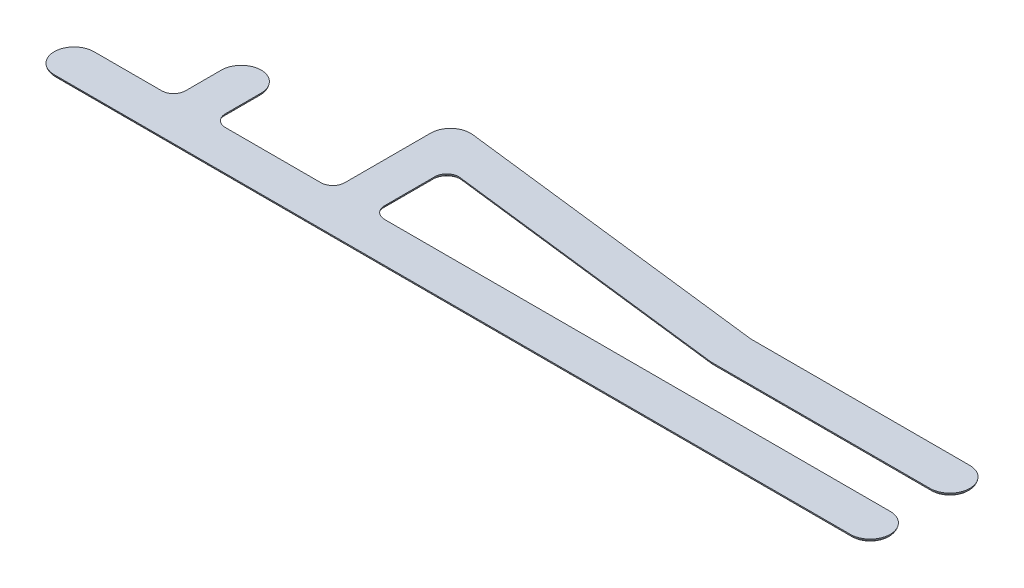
ISO-10303-21;
HEADER;
FILE_DESCRIPTION(('STEP AP214'),'2;1');
FILE_NAME('part.step','',(''),(''),'','','');
FILE_SCHEMA(('AUTOMOTIVE_DESIGN { 1 0 10303 214 1 1 1 1 }'));
ENDSEC;
DATA;
#1=APPLICATION_CONTEXT('core data for automotive mechanical design processes');
#2=APPLICATION_PROTOCOL_DEFINITION('international standard','automotive_design',2000,#1);
#3=PRODUCT_CONTEXT('',#1,'mechanical');
#4=PRODUCT('Part','Part','',(#3));
#5=PRODUCT_RELATED_PRODUCT_CATEGORY('part','',(#4));
#6=PRODUCT_DEFINITION_FORMATION('','',#4);
#7=PRODUCT_DEFINITION_CONTEXT('part definition',#1,'design');
#8=PRODUCT_DEFINITION('design','',#6,#7);
#9=PRODUCT_DEFINITION_SHAPE('','',#8);
#10=(LENGTH_UNIT() NAMED_UNIT(*) SI_UNIT(.MILLI.,.METRE.));
#11=(NAMED_UNIT(*) PLANE_ANGLE_UNIT() SI_UNIT($,.RADIAN.));
#12=(NAMED_UNIT(*) SI_UNIT($,.STERADIAN.) SOLID_ANGLE_UNIT());
#13=UNCERTAINTY_MEASURE_WITH_UNIT(LENGTH_MEASURE(1.E-05),#10,'distance_accuracy_value','');
#14=(GEOMETRIC_REPRESENTATION_CONTEXT(3) GLOBAL_UNCERTAINTY_ASSIGNED_CONTEXT((#13)) GLOBAL_UNIT_ASSIGNED_CONTEXT((#10,
#11,#12)) REPRESENTATION_CONTEXT('',''));
#15=CARTESIAN_POINT('',(0.,0.,0.));
#16=DIRECTION('',(0.,0.,1.));
#17=DIRECTION('',(1.,0.,0.));
#18=AXIS2_PLACEMENT_3D('',#15,#16,#17);
#19=CARTESIAN_POINT('',(200.,-1.,0.));
#20=DIRECTION('',(0.,-1.,0.));
#21=DIRECTION('',(0.,0.,-1.));
#22=AXIS2_PLACEMENT_3D('',#19,#20,#21);
#23=PLANE('',#22);
#24=DIRECTION('',(1.,0.,0.));
#25=VECTOR('',#24,1.);
#26=CARTESIAN_POINT('',(57.,-1.,-3.81678404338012));
#27=LINE('',#26,#25);
#28=CARTESIAN_POINT('',(33.,-1.,-3.81678404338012));
#29=VERTEX_POINT('',#28);
#30=CARTESIAN_POINT('',(57.,-1.,-3.81678404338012));
#31=VERTEX_POINT('',#30);
#32=EDGE_CURVE('E337',#29,#31,#27,.T.);
#33=ORIENTED_EDGE('',*,*,#32,.T.);
#34=CARTESIAN_POINT('',(57.,-1.,-8.00000000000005));
#35=DIRECTION('',(0.,-1.,0.));
#36=DIRECTION('',(0.,0.,-1.));
#37=AXIS2_PLACEMENT_3D('',#34,#35,#36);
#38=CIRCLE('',#37,4.18321595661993);
#39=CARTESIAN_POINT('',(61.18321595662,-1.,-8.00000000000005));
#40=VERTEX_POINT('',#39);
#41=EDGE_CURVE('E11',#31,#40,#38,.F.);
#42=ORIENTED_EDGE('',*,*,#41,.T.);
#43=DIRECTION('',(0.,0.,-1.));
#44=VECTOR('',#43,1.);
#45=CARTESIAN_POINT('',(61.18321595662,-1.,-29.56));
#46=LINE('',#45,#44);
#47=CARTESIAN_POINT('',(61.18321595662,-1.,-29.56));
#48=VERTEX_POINT('',#47);
#49=EDGE_CURVE('E41',#40,#48,#46,.T.);
#50=ORIENTED_EDGE('',*,*,#49,.T.);
#51=CARTESIAN_POINT('',(65.0000000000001,-1.,-29.56));
#52=DIRECTION('',(0.,-1.,0.));
#53=DIRECTION('',(0.,0.,-1.));
#54=AXIS2_PLACEMENT_3D('',#51,#52,#53);
#55=CIRCLE('',#54,3.81678404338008);
#56=CARTESIAN_POINT('',(65.4545573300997,-1.,-33.3496197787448));
#57=VERTEX_POINT('',#56);
#58=EDGE_CURVE('E262',#48,#57,#55,.T.);
#59=ORIENTED_EDGE('',*,*,#58,.T.);
#60=DIRECTION('',(0.992882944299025,0.,0.119094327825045));
#61=VECTOR('',#60,1.);
#62=CARTESIAN_POINT('',(144.562413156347,-1.,-23.8607903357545));
#63=LINE('',#62,#61);
#64=CARTESIAN_POINT('',(144.562413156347,-1.,-23.8607903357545));
#65=VERTEX_POINT('',#64);
#66=EDGE_CURVE('E260',#57,#65,#63,.T.);
#67=ORIENTED_EDGE('',*,*,#66,.T.);
#68=CARTESIAN_POINT('',(145.298799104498,-1.,-30.));
#69=DIRECTION('',(0.,-1.,0.));
#70=DIRECTION('',(0.,0.,-1.));
#71=AXIS2_PLACEMENT_3D('',#68,#69,#70);
#72=CIRCLE('',#71,6.18321595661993);
#73=CARTESIAN_POINT('',(145.298799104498,-1.,-23.8167840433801));
#74=VERTEX_POINT('',#73);
#75=EDGE_CURVE('E258',#65,#74,#72,.F.);
#76=ORIENTED_EDGE('',*,*,#75,.T.);
#77=DIRECTION('',(1.,0.,0.));
#78=VECTOR('',#77,1.);
#79=CARTESIAN_POINT('',(200.,-1.,-23.8167840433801));
#80=LINE('',#79,#78);
#81=CARTESIAN_POINT('',(200.,-1.,-23.8167840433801));
#82=VERTEX_POINT('',#81);
#83=EDGE_CURVE('E256',#74,#82,#80,.T.);
#84=ORIENTED_EDGE('',*,*,#83,.T.);
#85=CARTESIAN_POINT('',(200.,-1.,-19.9999999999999));
#86=DIRECTION('',(0.,-1.,0.));
#87=DIRECTION('',(0.,0.,-1.));
#88=AXIS2_PLACEMENT_3D('',#85,#86,#87);
#89=CIRCLE('',#88,3.81678404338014);
#90=CARTESIAN_POINT('',(200.,-1.,-16.1832159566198));
#91=VERTEX_POINT('',#90);
#92=EDGE_CURVE('E254',#82,#91,#89,.T.);
#93=ORIENTED_EDGE('',*,*,#92,.T.);
#94=DIRECTION('',(-1.,0.,0.));
#95=VECTOR('',#94,1.);
#96=CARTESIAN_POINT('',(145.298799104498,-1.,-16.1832159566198));
#97=LINE('',#96,#95);
#98=CARTESIAN_POINT('',(145.298799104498,-1.,-16.1832159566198));
#99=VERTEX_POINT('',#98);
#100=EDGE_CURVE('E252',#91,#99,#97,.T.);
#101=ORIENTED_EDGE('',*,*,#100,.T.);
#102=CARTESIAN_POINT('',(145.298799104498,-1.,-19.9999999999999));
#103=DIRECTION('',(0.,-1.,0.));
#104=DIRECTION('',(0.,0.,-1.));
#105=AXIS2_PLACEMENT_3D('',#102,#103,#104);
#106=CIRCLE('',#105,3.81678404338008);
#107=CARTESIAN_POINT('',(144.844241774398,-1.,-16.2103802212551));
#108=VERTEX_POINT('',#107);
#109=EDGE_CURVE('E250',#99,#108,#106,.T.);
#110=ORIENTED_EDGE('',*,*,#109,.T.);
#111=DIRECTION('',(-0.992882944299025,0.,-0.119094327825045));
#112=VECTOR('',#111,1.);
#113=CARTESIAN_POINT('',(73.4981972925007,-1.,-24.7681958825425));
#114=LINE('',#113,#112);
#115=CARTESIAN_POINT('',(73.4981972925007,-1.,-24.7681958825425));
#116=VERTEX_POINT('',#115);
#117=EDGE_CURVE('E248',#108,#116,#114,.T.);
#118=ORIENTED_EDGE('',*,*,#117,.T.);
#119=CARTESIAN_POINT('',(73.0000000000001,-1.,-20.614752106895));
#120=DIRECTION('',(0.,-1.,0.));
#121=DIRECTION('',(0.,0.,-1.));
#122=AXIS2_PLACEMENT_3D('',#119,#120,#121);
#123=CIRCLE('',#122,4.18321595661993);
#124=CARTESIAN_POINT('',(68.8167840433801,-1.,-20.614752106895));
#125=VERTEX_POINT('',#124);
#126=EDGE_CURVE('E242',#116,#125,#123,.F.);
#127=ORIENTED_EDGE('',*,*,#126,.T.);
#128=DIRECTION('',(0.,0.,1.));
#129=VECTOR('',#128,1.);
#130=CARTESIAN_POINT('',(68.8167840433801,-1.,-7.99999999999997));
#131=LINE('',#130,#129);
#132=CARTESIAN_POINT('',(68.8167840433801,-1.,-7.99999999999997));
#133=VERTEX_POINT('',#132);
#134=EDGE_CURVE('E235',#125,#133,#131,.T.);
#135=ORIENTED_EDGE('',*,*,#134,.T.);
#136=CARTESIAN_POINT('',(73.0000000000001,-1.,-7.99999999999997));
#137=DIRECTION('',(0.,-1.,0.));
#138=DIRECTION('',(0.,0.,-1.));
#139=AXIS2_PLACEMENT_3D('',#136,#137,#138);
#140=CIRCLE('',#139,4.18321595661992);
#141=CARTESIAN_POINT('',(73.0000000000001,-1.,-3.81678404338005));
#142=VERTEX_POINT('',#141);
#143=EDGE_CURVE('E239',#133,#142,#140,.F.);
#144=ORIENTED_EDGE('',*,*,#143,.T.);
#145=DIRECTION('',(1.,0.,0.));
#146=VECTOR('',#145,1.);
#147=CARTESIAN_POINT('',(200.,-1.,-3.81678404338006));
#148=LINE('',#147,#146);
#149=CARTESIAN_POINT('',(200.,-1.,-3.81678404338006));
#150=VERTEX_POINT('',#149);
#151=EDGE_CURVE('E240',#142,#150,#148,.T.);
#152=ORIENTED_EDGE('',*,*,#151,.T.);
#153=CARTESIAN_POINT('',(200.,-1.,0.));
#154=DIRECTION('',(0.,-1.,0.));
#155=DIRECTION('',(0.,0.,-1.));
#156=AXIS2_PLACEMENT_3D('',#153,#154,#155);
#157=CIRCLE('',#156,3.81678404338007);
#158=CARTESIAN_POINT('',(200.,-1.,3.81678404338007));
#159=VERTEX_POINT('',#158);
#160=EDGE_CURVE('E218',#150,#159,#157,.T.);
#161=ORIENTED_EDGE('',*,*,#160,.T.);
#162=DIRECTION('',(-1.,0.,0.));
#163=VECTOR('',#162,1.);
#164=CARTESIAN_POINT('',(0.,-1.,3.81678404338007));
#165=LINE('',#164,#163);
#166=CARTESIAN_POINT('',(0.,-1.,3.81678404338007));
#167=VERTEX_POINT('',#166);
#168=EDGE_CURVE('E319',#159,#167,#165,.T.);
#169=ORIENTED_EDGE('',*,*,#168,.T.);
#170=CARTESIAN_POINT('',(0.,-1.,0.));
#171=DIRECTION('',(0.,-1.,0.));
#172=DIRECTION('',(0.,0.,-1.));
#173=AXIS2_PLACEMENT_3D('',#170,#171,#172);
#174=CIRCLE('',#173,3.8167840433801);
#175=CARTESIAN_POINT('',(0.,-1.,-3.81678404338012));
#176=VERTEX_POINT('',#175);
#177=EDGE_CURVE('E321',#167,#176,#174,.T.);
#178=ORIENTED_EDGE('',*,*,#177,.T.);
#179=DIRECTION('',(1.,0.,0.));
#180=VECTOR('',#179,1.);
#181=CARTESIAN_POINT('',(17.,-1.,-3.81678404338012));
#182=LINE('',#181,#180);
#183=CARTESIAN_POINT('',(17.,-1.,-3.81678404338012));
#184=VERTEX_POINT('',#183);
#185=EDGE_CURVE('E323',#176,#184,#182,.T.);
#186=ORIENTED_EDGE('',*,*,#185,.T.);
#187=CARTESIAN_POINT('',(17.,-1.,-8.00000000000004));
#188=DIRECTION('',(0.,-1.,0.));
#189=DIRECTION('',(0.,0.,-1.));
#190=AXIS2_PLACEMENT_3D('',#187,#188,#189);
#191=CIRCLE('',#190,4.18321595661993);
#192=CARTESIAN_POINT('',(21.1832159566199,-1.,-8.00000000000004));
#193=VERTEX_POINT('',#192);
#194=EDGE_CURVE('E327',#184,#193,#191,.F.);
#195=ORIENTED_EDGE('',*,*,#194,.T.);
#196=DIRECTION('',(0.,0.,-1.));
#197=VECTOR('',#196,1.);
#198=CARTESIAN_POINT('',(21.1832159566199,-1.,-17.));
#199=LINE('',#198,#197);
#200=CARTESIAN_POINT('',(21.1832159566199,-1.,-17.));
#201=VERTEX_POINT('',#200);
#202=EDGE_CURVE('E329',#193,#201,#199,.T.);
#203=ORIENTED_EDGE('',*,*,#202,.T.);
#204=CARTESIAN_POINT('',(25.,-1.,-17.));
#205=DIRECTION('',(0.,-1.,0.));
#206=DIRECTION('',(0.,0.,-1.));
#207=AXIS2_PLACEMENT_3D('',#204,#205,#206);
#208=CIRCLE('',#207,3.81678404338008);
#209=CARTESIAN_POINT('',(28.8167840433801,-1.,-17.));
#210=VERTEX_POINT('',#209);
#211=EDGE_CURVE('E331',#201,#210,#208,.T.);
#212=ORIENTED_EDGE('',*,*,#211,.T.);
#213=DIRECTION('',(0.,0.,1.));
#214=VECTOR('',#213,1.);
#215=CARTESIAN_POINT('',(28.8167840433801,-1.,-8.00000000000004));
#216=LINE('',#215,#214);
#217=CARTESIAN_POINT('',(28.8167840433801,-1.,-8.00000000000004));
#218=VERTEX_POINT('',#217);
#219=EDGE_CURVE('E333',#210,#218,#216,.T.);
#220=ORIENTED_EDGE('',*,*,#219,.T.);
#221=CARTESIAN_POINT('',(33.,-1.,-8.00000000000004));
#222=DIRECTION('',(0.,-1.,0.));
#223=DIRECTION('',(0.,0.,-1.));
#224=AXIS2_PLACEMENT_3D('',#221,#222,#223);
#225=CIRCLE('',#224,4.18321595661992);
#226=EDGE_CURVE('E335',#218,#29,#225,.F.);
#227=ORIENTED_EDGE('',*,*,#226,.T.);
#228=EDGE_LOOP('',(#33,#42,#50,#59,#67,#76,#84,#93,#101,#110,#118,#127,#135,#144,#152,#161,#169,
#178,#186,#195,#203,#212,#220,#227));
#229=FACE_BOUND('',#228,.T.);
#230=ADVANCED_FACE('F32',(#229),#23,.T.);
#231=CARTESIAN_POINT('',(200.,0.,0.));
#232=DIRECTION('',(0.,-1.,0.));
#233=DIRECTION('',(0.,0.,-1.));
#234=AXIS2_PLACEMENT_3D('',#231,#232,#233);
#235=PLANE('',#234);
#236=CARTESIAN_POINT('',(200.,0.,0.));
#237=DIRECTION('',(0.,1.,0.));
#238=DIRECTION('',(0.,0.,-1.));
#239=AXIS2_PLACEMENT_3D('',#236,#237,#238);
#240=CIRCLE('',#239,4.99999999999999);
#241=CARTESIAN_POINT('',(200.,0.,5.));
#242=VERTEX_POINT('',#241);
#243=CARTESIAN_POINT('',(200.,0.,-4.99999999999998));
#244=VERTEX_POINT('',#243);
#245=EDGE_CURVE('E194',#242,#244,#240,.T.);
#246=ORIENTED_EDGE('',*,*,#245,.T.);
#247=DIRECTION('',(-1.,0.,0.));
#248=VECTOR('',#247,1.);
#249=CARTESIAN_POINT('',(73.0000000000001,0.,-4.99999999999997));
#250=LINE('',#249,#248);
#251=CARTESIAN_POINT('',(73.0000000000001,0.,-4.99999999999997));
#252=VERTEX_POINT('',#251);
#253=EDGE_CURVE('E197',#244,#252,#250,.T.);
#254=ORIENTED_EDGE('',*,*,#253,.T.);
#255=CARTESIAN_POINT('',(73.0000000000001,0.,-7.99999999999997));
#256=DIRECTION('',(0.,-1.,0.));
#257=DIRECTION('',(0.,0.,1.));
#258=AXIS2_PLACEMENT_3D('',#255,#256,#257);
#259=CIRCLE('',#258,3.);
#260=CARTESIAN_POINT('',(70.0000000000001,0.,-7.99999999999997));
#261=VERTEX_POINT('',#260);
#262=EDGE_CURVE('E215',#252,#261,#259,.T.);
#263=ORIENTED_EDGE('',*,*,#262,.T.);
#264=DIRECTION('',(0.,0.,-1.));
#265=VECTOR('',#264,1.);
#266=CARTESIAN_POINT('',(70.0000000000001,0.,-20.614752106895));
#267=LINE('',#266,#265);
#268=CARTESIAN_POINT('',(70.0000000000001,0.,-20.614752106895));
#269=VERTEX_POINT('',#268);
#270=EDGE_CURVE('E236',#261,#269,#267,.T.);
#271=ORIENTED_EDGE('',*,*,#270,.T.);
#272=CARTESIAN_POINT('',(73.0000000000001,0.,-20.614752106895));
#273=DIRECTION('',(0.,-1.,0.));
#274=DIRECTION('',(0.,0.,1.));
#275=AXIS2_PLACEMENT_3D('',#272,#273,#274);
#276=CIRCLE('',#275,3.00000000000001);
#277=CARTESIAN_POINT('',(73.3572829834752,0.,-23.5934009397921));
#278=VERTEX_POINT('',#277);
#279=EDGE_CURVE('E377',#269,#278,#276,.T.);
#280=ORIENTED_EDGE('',*,*,#279,.T.);
#281=DIRECTION('',(0.992882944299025,0.,0.119094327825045));
#282=VECTOR('',#281,1.);
#283=CARTESIAN_POINT('',(144.703327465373,0.,-15.0355852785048));
#284=LINE('',#283,#282);
#285=CARTESIAN_POINT('',(144.703327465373,0.,-15.0355852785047));
#286=VERTEX_POINT('',#285);
#287=EDGE_CURVE('E375',#278,#286,#284,.T.);
#288=ORIENTED_EDGE('',*,*,#287,.T.);
#289=CARTESIAN_POINT('',(145.298799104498,0.,-19.9999999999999));
#290=DIRECTION('',(0.,1.,0.));
#291=DIRECTION('',(0.,0.,1.));
#292=AXIS2_PLACEMENT_3D('',#289,#290,#291);
#293=CIRCLE('',#292,5.);
#294=CARTESIAN_POINT('',(145.298799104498,0.,-14.9999999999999));
#295=VERTEX_POINT('',#294);
#296=EDGE_CURVE('E373',#286,#295,#293,.T.);
#297=ORIENTED_EDGE('',*,*,#296,.T.);
#298=DIRECTION('',(1.,0.,0.));
#299=VECTOR('',#298,1.);
#300=CARTESIAN_POINT('',(200.,0.,-14.9999999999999));
#301=LINE('',#300,#299);
#302=CARTESIAN_POINT('',(200.,0.,-14.9999999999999));
#303=VERTEX_POINT('',#302);
#304=EDGE_CURVE('E371',#295,#303,#301,.T.);
#305=ORIENTED_EDGE('',*,*,#304,.T.);
#306=CARTESIAN_POINT('',(200.,0.,-19.9999999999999));
#307=DIRECTION('',(0.,1.,0.));
#308=DIRECTION('',(0.,0.,-1.));
#309=AXIS2_PLACEMENT_3D('',#306,#307,#308);
#310=CIRCLE('',#309,5.00000000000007);
#311=CARTESIAN_POINT('',(200.,0.,-25.));
#312=VERTEX_POINT('',#311);
#313=EDGE_CURVE('E369',#303,#312,#310,.T.);
#314=ORIENTED_EDGE('',*,*,#313,.T.);
#315=DIRECTION('',(-1.,0.,0.));
#316=VECTOR('',#315,1.);
#317=CARTESIAN_POINT('',(200.,0.,-25.));
#318=LINE('',#317,#316);
#319=CARTESIAN_POINT('',(145.298799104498,0.,-25.));
#320=VERTEX_POINT('',#319);
#321=EDGE_CURVE('E367',#312,#320,#318,.T.);
#322=ORIENTED_EDGE('',*,*,#321,.T.);
#323=CARTESIAN_POINT('',(145.298799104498,0.,-30.));
#324=DIRECTION('',(0.,-1.,0.));
#325=DIRECTION('',(0.,0.,1.));
#326=AXIS2_PLACEMENT_3D('',#323,#324,#325);
#327=CIRCLE('',#326,5.);
#328=CARTESIAN_POINT('',(144.703327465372,0.,-25.0355852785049));
#329=VERTEX_POINT('',#328);
#330=EDGE_CURVE('E365',#320,#329,#327,.T.);
#331=ORIENTED_EDGE('',*,*,#330,.T.);
#332=DIRECTION('',(-0.992882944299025,0.,-0.119094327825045));
#333=VECTOR('',#332,1.);
#334=CARTESIAN_POINT('',(144.703327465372,0.,-25.0355852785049));
#335=LINE('',#334,#333);
#336=CARTESIAN_POINT('',(65.5954716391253,0.,-34.5244147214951));
#337=VERTEX_POINT('',#336);
#338=EDGE_CURVE('E363',#329,#337,#335,.T.);
#339=ORIENTED_EDGE('',*,*,#338,.T.);
#340=CARTESIAN_POINT('',(65.0000000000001,0.,-29.56));
#341=DIRECTION('',(0.,1.,0.));
#342=DIRECTION('',(0.,0.,-1.));
#343=AXIS2_PLACEMENT_3D('',#340,#341,#342);
#344=CIRCLE('',#343,5.00000000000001);
#345=CARTESIAN_POINT('',(60.0000000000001,0.,-29.56));
#346=VERTEX_POINT('',#345);
#347=EDGE_CURVE('E361',#337,#346,#344,.T.);
#348=ORIENTED_EDGE('',*,*,#347,.T.);
#349=DIRECTION('',(0.,0.,1.));
#350=VECTOR('',#349,1.);
#351=CARTESIAN_POINT('',(60.0000000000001,0.,-8.00000000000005));
#352=LINE('',#351,#350);
#353=CARTESIAN_POINT('',(60.0000000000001,0.,-8.00000000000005));
#354=VERTEX_POINT('',#353);
#355=EDGE_CURVE('E359',#346,#354,#352,.T.);
#356=ORIENTED_EDGE('',*,*,#355,.T.);
#357=CARTESIAN_POINT('',(57.,0.,-8.00000000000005));
#358=DIRECTION('',(0.,-1.,0.));
#359=DIRECTION('',(0.,0.,1.));
#360=AXIS2_PLACEMENT_3D('',#357,#358,#359);
#361=CIRCLE('',#360,3.);
#362=CARTESIAN_POINT('',(57.,0.,-5.00000000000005));
#363=VERTEX_POINT('',#362);
#364=EDGE_CURVE('E356',#354,#363,#361,.T.);
#365=ORIENTED_EDGE('',*,*,#364,.T.);
#366=DIRECTION('',(-1.,0.,0.));
#367=VECTOR('',#366,1.);
#368=CARTESIAN_POINT('',(33.,0.,-5.00000000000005));
#369=LINE('',#368,#367);
#370=CARTESIAN_POINT('',(33.,0.,-5.00000000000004));
#371=VERTEX_POINT('',#370);
#372=EDGE_CURVE('E354',#363,#371,#369,.T.);
#373=ORIENTED_EDGE('',*,*,#372,.T.);
#374=CARTESIAN_POINT('',(33.,0.,-8.00000000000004));
#375=DIRECTION('',(0.,-1.,0.));
#376=DIRECTION('',(0.,0.,1.));
#377=AXIS2_PLACEMENT_3D('',#374,#375,#376);
#378=CIRCLE('',#377,3.);
#379=CARTESIAN_POINT('',(30.,0.,-8.00000000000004));
#380=VERTEX_POINT('',#379);
#381=EDGE_CURVE('E352',#371,#380,#378,.T.);
#382=ORIENTED_EDGE('',*,*,#381,.T.);
#383=DIRECTION('',(0.,0.,-1.));
#384=VECTOR('',#383,1.);
#385=CARTESIAN_POINT('',(30.,0.,-17.));
#386=LINE('',#385,#384);
#387=CARTESIAN_POINT('',(30.,0.,-17.));
#388=VERTEX_POINT('',#387);
#389=EDGE_CURVE('E350',#380,#388,#386,.T.);
#390=ORIENTED_EDGE('',*,*,#389,.T.);
#391=CARTESIAN_POINT('',(25.,0.,-17.));
#392=DIRECTION('',(0.,1.,0.));
#393=DIRECTION('',(0.,0.,-1.));
#394=AXIS2_PLACEMENT_3D('',#391,#392,#393);
#395=CIRCLE('',#394,5.);
#396=CARTESIAN_POINT('',(20.,0.,-17.));
#397=VERTEX_POINT('',#396);
#398=EDGE_CURVE('E348',#388,#397,#395,.T.);
#399=ORIENTED_EDGE('',*,*,#398,.T.);
#400=DIRECTION('',(0.,0.,1.));
#401=VECTOR('',#400,1.);
#402=CARTESIAN_POINT('',(20.,0.,-8.00000000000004));
#403=LINE('',#402,#401);
#404=CARTESIAN_POINT('',(20.,0.,-8.00000000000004));
#405=VERTEX_POINT('',#404);
#406=EDGE_CURVE('E346',#397,#405,#403,.T.);
#407=ORIENTED_EDGE('',*,*,#406,.T.);
#408=CARTESIAN_POINT('',(17.,0.,-8.00000000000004));
#409=DIRECTION('',(0.,-1.,0.));
#410=DIRECTION('',(0.,0.,1.));
#411=AXIS2_PLACEMENT_3D('',#408,#409,#410);
#412=CIRCLE('',#411,3.);
#413=CARTESIAN_POINT('',(17.,0.,-5.00000000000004));
#414=VERTEX_POINT('',#413);
#415=EDGE_CURVE('E344',#405,#414,#412,.T.);
#416=ORIENTED_EDGE('',*,*,#415,.T.);
#417=DIRECTION('',(-1.,0.,0.));
#418=VECTOR('',#417,1.);
#419=CARTESIAN_POINT('',(0.,0.,-5.00000000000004));
#420=LINE('',#419,#418);
#421=CARTESIAN_POINT('',(0.,0.,-5.00000000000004));
#422=VERTEX_POINT('',#421);
#423=EDGE_CURVE('E342',#414,#422,#420,.T.);
#424=ORIENTED_EDGE('',*,*,#423,.T.);
#425=CARTESIAN_POINT('',(0.,0.,0.));
#426=DIRECTION('',(0.,1.,0.));
#427=DIRECTION('',(0.,0.,-1.));
#428=AXIS2_PLACEMENT_3D('',#425,#426,#427);
#429=CIRCLE('',#428,5.00000000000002);
#430=CARTESIAN_POINT('',(0.,0.,5.));
#431=VERTEX_POINT('',#430);
#432=EDGE_CURVE('E340',#422,#431,#429,.T.);
#433=ORIENTED_EDGE('',*,*,#432,.T.);
#434=DIRECTION('',(1.,0.,0.));
#435=VECTOR('',#434,1.);
#436=CARTESIAN_POINT('',(200.,0.,5.));
#437=LINE('',#436,#435);
#438=EDGE_CURVE('E200',#431,#242,#437,.T.);
#439=ORIENTED_EDGE('',*,*,#438,.T.);
#440=EDGE_LOOP('',(#246,#254,#263,#271,#280,#288,#297,#305,#314,#322,#331,#339,#348,#356,#365,
#373,#382,#390,#399,#407,#416,#424,#433,#439));
#441=FACE_BOUND('',#440,.T.);
#442=ADVANCED_FACE('F196',(#441),#235,.F.);
#443=CARTESIAN_POINT('',(73.0000000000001,0.2,-7.99999999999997));
#444=DIRECTION('',(0.,-1.,0.));
#445=DIRECTION('',(0.,0.,-1.));
#446=AXIS2_PLACEMENT_3D('',#443,#444,#445);
#447=TOROIDAL_SURFACE('',#446,4.18321595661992,1.2);
#448=CARTESIAN_POINT('',(73.0000000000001,0.2,-3.81678404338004));
#449=DIRECTION('',(1.,0.,0.));
#450=DIRECTION('',(0.,0.,-1.));
#451=AXIS2_PLACEMENT_3D('',#448,#449,#450);
#452=CIRCLE('',#451,1.2);
#453=EDGE_CURVE('E214',#142,#252,#452,.T.);
#454=ORIENTED_EDGE('',*,*,#453,.F.);
#455=ORIENTED_EDGE('',*,*,#143,.F.);
#456=CARTESIAN_POINT('',(68.81678404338,0.2,-7.99999999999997));
#457=DIRECTION('',(0.,0.,-1.));
#458=DIRECTION('',(-1.,0.,0.));
#459=AXIS2_PLACEMENT_3D('',#456,#457,#458);
#460=CIRCLE('',#459,1.2);
#461=EDGE_CURVE('E36',#261,#133,#460,.T.);
#462=ORIENTED_EDGE('',*,*,#461,.F.);
#463=ORIENTED_EDGE('',*,*,#262,.F.);
#464=EDGE_LOOP('',(#454,#455,#462,#463));
#465=FACE_BOUND('',#464,.T.);
#466=ADVANCED_FACE('F34',(#465),#447,.T.);
#467=CARTESIAN_POINT('',(68.8167840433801,0.2,-20.614752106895));
#468=DIRECTION('',(0.,0.,-1.));
#469=DIRECTION('',(-1.,0.,0.));
#470=AXIS2_PLACEMENT_3D('',#467,#468,#469);
#471=CYLINDRICAL_SURFACE('',#470,1.2);
#472=ORIENTED_EDGE('',*,*,#461,.T.);
#473=ORIENTED_EDGE('',*,*,#134,.F.);
#474=CARTESIAN_POINT('',(68.81678404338,0.2,-20.614752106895));
#475=DIRECTION('',(0.,0.,-1.));
#476=DIRECTION('',(-1.,0.,0.));
#477=AXIS2_PLACEMENT_3D('',#474,#475,#476);
#478=CIRCLE('',#477,1.2);
#479=EDGE_CURVE('E219',#269,#125,#478,.T.);
#480=ORIENTED_EDGE('',*,*,#479,.F.);
#481=ORIENTED_EDGE('',*,*,#270,.F.);
#482=EDGE_LOOP('',(#472,#473,#480,#481));
#483=FACE_BOUND('',#482,.T.);
#484=ADVANCED_FACE('F233',(#483),#471,.T.);
#485=CARTESIAN_POINT('',(73.0000000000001,0.2,-3.81678404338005));
#486=DIRECTION('',(-1.,0.,0.));
#487=DIRECTION('',(0.,0.,1.));
#488=AXIS2_PLACEMENT_3D('',#485,#486,#487);
#489=CYLINDRICAL_SURFACE('',#488,1.2);
#490=ORIENTED_EDGE('',*,*,#453,.T.);
#491=ORIENTED_EDGE('',*,*,#253,.F.);
#492=CARTESIAN_POINT('',(200.,0.2,-3.81678404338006));
#493=DIRECTION('',(1.,0.,0.));
#494=DIRECTION('',(0.,0.,-1.));
#495=AXIS2_PLACEMENT_3D('',#492,#493,#494);
#496=CIRCLE('',#495,1.2);
#497=EDGE_CURVE('E211',#150,#244,#496,.T.);
#498=ORIENTED_EDGE('',*,*,#497,.F.);
#499=ORIENTED_EDGE('',*,*,#151,.F.);
#500=EDGE_LOOP('',(#490,#491,#498,#499));
#501=FACE_BOUND('',#500,.T.);
#502=ADVANCED_FACE('F209',(#501),#489,.T.);
#503=CARTESIAN_POINT('',(73.0000000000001,0.2,-20.614752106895));
#504=DIRECTION('',(0.,-1.,0.));
#505=DIRECTION('',(0.,0.,-1.));
#506=AXIS2_PLACEMENT_3D('',#503,#504,#505);
#507=TOROIDAL_SURFACE('',#506,4.18321595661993,1.2);
#508=ORIENTED_EDGE('',*,*,#479,.T.);
#509=ORIENTED_EDGE('',*,*,#126,.F.);
#510=CARTESIAN_POINT('',(73.4981972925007,0.2,-24.7681958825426));
#511=DIRECTION('',(0.992882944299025,0.,0.119094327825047));
#512=DIRECTION('',(0.119094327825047,0.,-0.992882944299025));
#513=AXIS2_PLACEMENT_3D('',#510,#511,#512);
#514=CIRCLE('',#513,1.2);
#515=EDGE_CURVE('E220',#278,#116,#514,.T.);
#516=ORIENTED_EDGE('',*,*,#515,.F.);
#517=ORIENTED_EDGE('',*,*,#279,.F.);
#518=EDGE_LOOP('',(#508,#509,#516,#517));
#519=FACE_BOUND('',#518,.T.);
#520=ADVANCED_FACE('F384',(#519),#507,.T.);
#521=CARTESIAN_POINT('',(200.,0.2,0.));
#522=DIRECTION('',(0.,1.,0.));
#523=DIRECTION('',(0.,0.,1.));
#524=AXIS2_PLACEMENT_3D('',#521,#522,#523);
#525=TOROIDAL_SURFACE('',#524,3.81678404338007,1.2);
#526=ORIENTED_EDGE('',*,*,#497,.T.);
#527=ORIENTED_EDGE('',*,*,#245,.F.);
#528=CARTESIAN_POINT('',(200.,0.2,3.81678404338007));
#529=DIRECTION('',(-1.,0.,0.));
#530=DIRECTION('',(0.,0.,1.));
#531=AXIS2_PLACEMENT_3D('',#528,#529,#530);
#532=CIRCLE('',#531,1.2);
#533=EDGE_CURVE('E225',#159,#242,#532,.T.);
#534=ORIENTED_EDGE('',*,*,#533,.F.);
#535=ORIENTED_EDGE('',*,*,#160,.F.);
#536=EDGE_LOOP('',(#526,#527,#534,#535));
#537=FACE_BOUND('',#536,.T.);
#538=ADVANCED_FACE('F217',(#537),#525,.T.);
#539=CARTESIAN_POINT('',(144.844241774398,0.2,-16.2103802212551));
#540=DIRECTION('',(0.992882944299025,0.,0.119094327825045));
#541=DIRECTION('',(0.119094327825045,0.,-0.992882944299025));
#542=AXIS2_PLACEMENT_3D('',#539,#540,#541);
#543=CYLINDRICAL_SURFACE('',#542,1.2);
#544=ORIENTED_EDGE('',*,*,#515,.T.);
#545=ORIENTED_EDGE('',*,*,#117,.F.);
#546=CARTESIAN_POINT('',(144.844241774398,0.2,-16.2103802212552));
#547=DIRECTION('',(0.992882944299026,0.,0.119094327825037));
#548=DIRECTION('',(0.119094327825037,0.,-0.992882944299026));
#549=AXIS2_PLACEMENT_3D('',#546,#547,#548);
#550=CIRCLE('',#549,1.2);
#551=EDGE_CURVE('E313',#286,#108,#550,.T.);
#552=ORIENTED_EDGE('',*,*,#551,.F.);
#553=ORIENTED_EDGE('',*,*,#287,.F.);
#554=EDGE_LOOP('',(#544,#545,#552,#553));
#555=FACE_BOUND('',#554,.T.);
#556=ADVANCED_FACE('F389',(#555),#543,.T.);
#557=CARTESIAN_POINT('',(200.,0.2,3.81678404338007));
#558=DIRECTION('',(1.,0.,0.));
#559=DIRECTION('',(0.,0.,-1.));
#560=AXIS2_PLACEMENT_3D('',#557,#558,#559);
#561=CYLINDRICAL_SURFACE('',#560,1.2);
#562=ORIENTED_EDGE('',*,*,#533,.T.);
#563=ORIENTED_EDGE('',*,*,#438,.F.);
#564=CARTESIAN_POINT('',(0.,0.2,3.81678404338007));
#565=DIRECTION('',(-1.,0.,0.));
#566=DIRECTION('',(0.,0.,1.));
#567=AXIS2_PLACEMENT_3D('',#564,#565,#566);
#568=CIRCLE('',#567,1.2);
#569=EDGE_CURVE('E310',#167,#431,#568,.T.);
#570=ORIENTED_EDGE('',*,*,#569,.F.);
#571=ORIENTED_EDGE('',*,*,#168,.F.);
#572=EDGE_LOOP('',(#562,#563,#570,#571));
#573=FACE_BOUND('',#572,.T.);
#574=ADVANCED_FACE('F317',(#573),#561,.T.);
#575=CARTESIAN_POINT('',(145.298799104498,0.2,-19.9999999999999));
#576=DIRECTION('',(0.,1.,0.));
#577=DIRECTION('',(0.,0.,1.));
#578=AXIS2_PLACEMENT_3D('',#575,#576,#577);
#579=TOROIDAL_SURFACE('',#578,3.81678404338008,1.2);
#580=ORIENTED_EDGE('',*,*,#551,.T.);
#581=ORIENTED_EDGE('',*,*,#109,.F.);
#582=CARTESIAN_POINT('',(145.298799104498,0.2,-16.1832159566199));
#583=DIRECTION('',(1.,0.,0.));
#584=DIRECTION('',(0.,0.,-1.));
#585=AXIS2_PLACEMENT_3D('',#582,#583,#584);
#586=CIRCLE('',#585,1.2);
#587=EDGE_CURVE('E307',#295,#99,#586,.T.);
#588=ORIENTED_EDGE('',*,*,#587,.F.);
#589=ORIENTED_EDGE('',*,*,#296,.F.);
#590=EDGE_LOOP('',(#580,#581,#588,#589));
#591=FACE_BOUND('',#590,.T.);
#592=ADVANCED_FACE('F396',(#591),#579,.T.);
#593=CARTESIAN_POINT('',(0.,0.2,0.));
#594=DIRECTION('',(0.,1.,0.));
#595=DIRECTION('',(0.,0.,1.));
#596=AXIS2_PLACEMENT_3D('',#593,#594,#595);
#597=TOROIDAL_SURFACE('',#596,3.8167840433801,1.2);
#598=ORIENTED_EDGE('',*,*,#569,.T.);
#599=ORIENTED_EDGE('',*,*,#432,.F.);
#600=CARTESIAN_POINT('',(0.,0.2,-3.81678404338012));
#601=DIRECTION('',(1.,0.,0.));
#602=DIRECTION('',(0.,0.,-1.));
#603=AXIS2_PLACEMENT_3D('',#600,#601,#602);
#604=CIRCLE('',#603,1.2);
#605=EDGE_CURVE('E304',#176,#422,#604,.T.);
#606=ORIENTED_EDGE('',*,*,#605,.F.);
#607=ORIENTED_EDGE('',*,*,#177,.F.);
#608=EDGE_LOOP('',(#598,#599,#606,#607));
#609=FACE_BOUND('',#608,.T.);
#610=ADVANCED_FACE('F466',(#609),#597,.T.);
#611=CARTESIAN_POINT('',(200.,0.2,-16.1832159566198));
#612=DIRECTION('',(1.,0.,0.));
#613=DIRECTION('',(0.,0.,-1.));
#614=AXIS2_PLACEMENT_3D('',#611,#612,#613);
#615=CYLINDRICAL_SURFACE('',#614,1.2);
#616=ORIENTED_EDGE('',*,*,#587,.T.);
#617=ORIENTED_EDGE('',*,*,#100,.F.);
#618=CARTESIAN_POINT('',(200.,0.2,-16.1832159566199));
#619=DIRECTION('',(1.,0.,0.));
#620=DIRECTION('',(0.,0.,-1.));
#621=AXIS2_PLACEMENT_3D('',#618,#619,#620);
#622=CIRCLE('',#621,1.2);
#623=EDGE_CURVE('E301',#303,#91,#622,.T.);
#624=ORIENTED_EDGE('',*,*,#623,.F.);
#625=ORIENTED_EDGE('',*,*,#304,.F.);
#626=EDGE_LOOP('',(#616,#617,#624,#625));
#627=FACE_BOUND('',#626,.T.);
#628=ADVANCED_FACE('F399',(#627),#615,.T.);
#629=CARTESIAN_POINT('',(0.,0.2,-3.81678404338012));
#630=DIRECTION('',(-1.,0.,0.));
#631=DIRECTION('',(0.,0.,1.));
#632=AXIS2_PLACEMENT_3D('',#629,#630,#631);
#633=CYLINDRICAL_SURFACE('',#632,1.2);
#634=ORIENTED_EDGE('',*,*,#605,.T.);
#635=ORIENTED_EDGE('',*,*,#423,.F.);
#636=CARTESIAN_POINT('',(17.,0.2,-3.81678404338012));
#637=DIRECTION('',(1.,0.,0.));
#638=DIRECTION('',(0.,0.,-1.));
#639=AXIS2_PLACEMENT_3D('',#636,#637,#638);
#640=CIRCLE('',#639,1.2);
#641=EDGE_CURVE('E298',#184,#414,#640,.T.);
#642=ORIENTED_EDGE('',*,*,#641,.F.);
#643=ORIENTED_EDGE('',*,*,#185,.F.);
#644=EDGE_LOOP('',(#634,#635,#642,#643));
#645=FACE_BOUND('',#644,.T.);
#646=ADVANCED_FACE('F462',(#645),#633,.T.);
#647=CARTESIAN_POINT('',(200.,0.2,-19.9999999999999));
#648=DIRECTION('',(0.,1.,0.));
#649=DIRECTION('',(0.,0.,1.));
#650=AXIS2_PLACEMENT_3D('',#647,#648,#649);
#651=TOROIDAL_SURFACE('',#650,3.81678404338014,1.2);
#652=ORIENTED_EDGE('',*,*,#623,.T.);
#653=ORIENTED_EDGE('',*,*,#92,.F.);
#654=CARTESIAN_POINT('',(200.,0.2,-23.81678404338));
#655=DIRECTION('',(-1.,0.,0.));
#656=DIRECTION('',(0.,0.,1.));
#657=AXIS2_PLACEMENT_3D('',#654,#655,#656);
#658=CIRCLE('',#657,1.2);
#659=EDGE_CURVE('E295',#312,#82,#658,.T.);
#660=ORIENTED_EDGE('',*,*,#659,.F.);
#661=ORIENTED_EDGE('',*,*,#313,.F.);
#662=EDGE_LOOP('',(#652,#653,#660,#661));
#663=FACE_BOUND('',#662,.T.);
#664=ADVANCED_FACE('F404',(#663),#651,.T.);
#665=CARTESIAN_POINT('',(17.,0.2,-8.00000000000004));
#666=DIRECTION('',(0.,-1.,0.));
#667=DIRECTION('',(0.,0.,-1.));
#668=AXIS2_PLACEMENT_3D('',#665,#666,#667);
#669=TOROIDAL_SURFACE('',#668,4.18321595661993,1.2);
#670=ORIENTED_EDGE('',*,*,#641,.T.);
#671=ORIENTED_EDGE('',*,*,#415,.F.);
#672=CARTESIAN_POINT('',(21.1832159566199,0.2,-8.00000000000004));
#673=DIRECTION('',(0.,0.,-1.));
#674=DIRECTION('',(-1.,0.,0.));
#675=AXIS2_PLACEMENT_3D('',#672,#673,#674);
#676=CIRCLE('',#675,1.2);
#677=EDGE_CURVE('E292',#193,#405,#676,.T.);
#678=ORIENTED_EDGE('',*,*,#677,.F.);
#679=ORIENTED_EDGE('',*,*,#194,.F.);
#680=EDGE_LOOP('',(#670,#671,#678,#679));
#681=FACE_BOUND('',#680,.T.);
#682=ADVANCED_FACE('F457',(#681),#669,.T.);
#683=CARTESIAN_POINT('',(200.,0.2,-23.8167840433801));
#684=DIRECTION('',(-1.,0.,0.));
#685=DIRECTION('',(0.,0.,1.));
#686=AXIS2_PLACEMENT_3D('',#683,#684,#685);
#687=CYLINDRICAL_SURFACE('',#686,1.2);
#688=ORIENTED_EDGE('',*,*,#659,.T.);
#689=ORIENTED_EDGE('',*,*,#83,.F.);
#690=CARTESIAN_POINT('',(145.298799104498,0.2,-23.81678404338));
#691=DIRECTION('',(-1.,0.,0.));
#692=DIRECTION('',(0.,0.,1.));
#693=AXIS2_PLACEMENT_3D('',#690,#691,#692);
#694=CIRCLE('',#693,1.2);
#695=EDGE_CURVE('E289',#320,#74,#694,.T.);
#696=ORIENTED_EDGE('',*,*,#695,.F.);
#697=ORIENTED_EDGE('',*,*,#321,.F.);
#698=EDGE_LOOP('',(#688,#689,#696,#697));
#699=FACE_BOUND('',#698,.T.);
#700=ADVANCED_FACE('F411',(#699),#687,.T.);
#701=CARTESIAN_POINT('',(21.1832159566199,0.2,-8.00000000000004));
#702=DIRECTION('',(0.,0.,1.));
#703=DIRECTION('',(1.,0.,0.));
#704=AXIS2_PLACEMENT_3D('',#701,#702,#703);
#705=CYLINDRICAL_SURFACE('',#704,1.2);
#706=ORIENTED_EDGE('',*,*,#677,.T.);
#707=ORIENTED_EDGE('',*,*,#406,.F.);
#708=CARTESIAN_POINT('',(21.1832159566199,0.2,-17.));
#709=DIRECTION('',(0.,0.,-1.));
#710=DIRECTION('',(-1.,0.,0.));
#711=AXIS2_PLACEMENT_3D('',#708,#709,#710);
#712=CIRCLE('',#711,1.2);
#713=EDGE_CURVE('E286',#201,#397,#712,.T.);
#714=ORIENTED_EDGE('',*,*,#713,.F.);
#715=ORIENTED_EDGE('',*,*,#202,.F.);
#716=EDGE_LOOP('',(#706,#707,#714,#715));
#717=FACE_BOUND('',#716,.T.);
#718=ADVANCED_FACE('F452',(#717),#705,.T.);
#719=CARTESIAN_POINT('',(145.298799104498,0.2,-30.));
#720=DIRECTION('',(0.,-1.,0.));
#721=DIRECTION('',(0.,0.,-1.));
#722=AXIS2_PLACEMENT_3D('',#719,#720,#721);
#723=TOROIDAL_SURFACE('',#722,6.18321595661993,1.2);
#724=ORIENTED_EDGE('',*,*,#695,.T.);
#725=ORIENTED_EDGE('',*,*,#75,.F.);
#726=CARTESIAN_POINT('',(144.562413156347,0.2,-23.8607903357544));
#727=DIRECTION('',(-0.992882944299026,0.,-0.119094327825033));
#728=DIRECTION('',(-0.119094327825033,0.,0.992882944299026));
#729=AXIS2_PLACEMENT_3D('',#726,#727,#728);
#730=CIRCLE('',#729,1.2);
#731=EDGE_CURVE('E283',#329,#65,#730,.T.);
#732=ORIENTED_EDGE('',*,*,#731,.F.);
#733=ORIENTED_EDGE('',*,*,#330,.F.);
#734=EDGE_LOOP('',(#724,#725,#732,#733));
#735=FACE_BOUND('',#734,.T.);
#736=ADVANCED_FACE('F414',(#735),#723,.T.);
#737=CARTESIAN_POINT('',(25.,0.2,-17.));
#738=DIRECTION('',(0.,1.,0.));
#739=DIRECTION('',(0.,0.,1.));
#740=AXIS2_PLACEMENT_3D('',#737,#738,#739);
#741=TOROIDAL_SURFACE('',#740,3.81678404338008,1.2);
#742=ORIENTED_EDGE('',*,*,#713,.T.);
#743=ORIENTED_EDGE('',*,*,#398,.F.);
#744=CARTESIAN_POINT('',(28.8167840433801,0.2,-17.));
#745=DIRECTION('',(0.,0.,1.));
#746=DIRECTION('',(1.,0.,0.));
#747=AXIS2_PLACEMENT_3D('',#744,#745,#746);
#748=CIRCLE('',#747,1.2);
#749=EDGE_CURVE('E280',#210,#388,#748,.T.);
#750=ORIENTED_EDGE('',*,*,#749,.F.);
#751=ORIENTED_EDGE('',*,*,#211,.F.);
#752=EDGE_LOOP('',(#742,#743,#750,#751));
#753=FACE_BOUND('',#752,.T.);
#754=ADVANCED_FACE('F448',(#753),#741,.T.);
#755=CARTESIAN_POINT('',(144.562413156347,0.2,-23.8607903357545));
#756=DIRECTION('',(-0.992882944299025,0.,-0.119094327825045));
#757=DIRECTION('',(-0.119094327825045,0.,0.992882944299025));
#758=AXIS2_PLACEMENT_3D('',#755,#756,#757);
#759=CYLINDRICAL_SURFACE('',#758,1.2);
#760=ORIENTED_EDGE('',*,*,#731,.T.);
#761=ORIENTED_EDGE('',*,*,#66,.F.);
#762=CARTESIAN_POINT('',(65.4545573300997,0.2,-33.3496197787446));
#763=DIRECTION('',(-0.992882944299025,0.,-0.119094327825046));
#764=DIRECTION('',(-0.119094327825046,0.,0.992882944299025));
#765=AXIS2_PLACEMENT_3D('',#762,#763,#764);
#766=CIRCLE('',#765,1.2);
#767=EDGE_CURVE('E277',#337,#57,#766,.T.);
#768=ORIENTED_EDGE('',*,*,#767,.F.);
#769=ORIENTED_EDGE('',*,*,#338,.F.);
#770=EDGE_LOOP('',(#760,#761,#768,#769));
#771=FACE_BOUND('',#770,.T.);
#772=ADVANCED_FACE('F419',(#771),#759,.T.);
#773=CARTESIAN_POINT('',(28.8167840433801,0.2,-17.));
#774=DIRECTION('',(0.,0.,-1.));
#775=DIRECTION('',(-1.,0.,0.));
#776=AXIS2_PLACEMENT_3D('',#773,#774,#775);
#777=CYLINDRICAL_SURFACE('',#776,1.2);
#778=ORIENTED_EDGE('',*,*,#749,.T.);
#779=ORIENTED_EDGE('',*,*,#389,.F.);
#780=CARTESIAN_POINT('',(28.8167840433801,0.2,-8.00000000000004));
#781=DIRECTION('',(0.,0.,1.));
#782=DIRECTION('',(1.,0.,0.));
#783=AXIS2_PLACEMENT_3D('',#780,#781,#782);
#784=CIRCLE('',#783,1.2);
#785=EDGE_CURVE('E274',#218,#380,#784,.T.);
#786=ORIENTED_EDGE('',*,*,#785,.F.);
#787=ORIENTED_EDGE('',*,*,#219,.F.);
#788=EDGE_LOOP('',(#778,#779,#786,#787));
#789=FACE_BOUND('',#788,.T.);
#790=ADVANCED_FACE('F444',(#789),#777,.T.);
#791=CARTESIAN_POINT('',(65.0000000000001,0.2,-29.56));
#792=DIRECTION('',(0.,1.,0.));
#793=DIRECTION('',(0.,0.,1.));
#794=AXIS2_PLACEMENT_3D('',#791,#792,#793);
#795=TOROIDAL_SURFACE('',#794,3.81678404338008,1.2);
#796=ORIENTED_EDGE('',*,*,#767,.T.);
#797=ORIENTED_EDGE('',*,*,#58,.F.);
#798=CARTESIAN_POINT('',(61.1832159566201,0.2,-29.56));
#799=DIRECTION('',(0.,0.,1.));
#800=DIRECTION('',(1.,0.,0.));
#801=AXIS2_PLACEMENT_3D('',#798,#799,#800);
#802=CIRCLE('',#801,1.2);
#803=EDGE_CURVE('E271',#346,#48,#802,.T.);
#804=ORIENTED_EDGE('',*,*,#803,.F.);
#805=ORIENTED_EDGE('',*,*,#347,.F.);
#806=EDGE_LOOP('',(#796,#797,#804,#805));
#807=FACE_BOUND('',#806,.T.);
#808=ADVANCED_FACE('F424',(#807),#795,.T.);
#809=CARTESIAN_POINT('',(33.,0.2,-8.00000000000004));
#810=DIRECTION('',(0.,-1.,0.));
#811=DIRECTION('',(0.,0.,-1.));
#812=AXIS2_PLACEMENT_3D('',#809,#810,#811);
#813=TOROIDAL_SURFACE('',#812,4.18321595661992,1.2);
#814=ORIENTED_EDGE('',*,*,#785,.T.);
#815=ORIENTED_EDGE('',*,*,#381,.F.);
#816=CARTESIAN_POINT('',(33.,0.2,-3.81678404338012));
#817=DIRECTION('',(1.,0.,0.));
#818=DIRECTION('',(0.,0.,-1.));
#819=AXIS2_PLACEMENT_3D('',#816,#817,#818);
#820=CIRCLE('',#819,1.2);
#821=EDGE_CURVE('E268',#29,#371,#820,.T.);
#822=ORIENTED_EDGE('',*,*,#821,.F.);
#823=ORIENTED_EDGE('',*,*,#226,.F.);
#824=EDGE_LOOP('',(#814,#815,#822,#823));
#825=FACE_BOUND('',#824,.T.);
#826=ADVANCED_FACE('F435',(#825),#813,.T.);
#827=CARTESIAN_POINT('',(61.18321595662,0.2,-8.00000000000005));
#828=DIRECTION('',(0.,0.,1.));
#829=DIRECTION('',(1.,0.,0.));
#830=AXIS2_PLACEMENT_3D('',#827,#828,#829);
#831=CYLINDRICAL_SURFACE('',#830,1.2);
#832=ORIENTED_EDGE('',*,*,#803,.T.);
#833=ORIENTED_EDGE('',*,*,#49,.F.);
#834=CARTESIAN_POINT('',(61.1832159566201,0.2,-8.00000000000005));
#835=DIRECTION('',(0.,0.,1.));
#836=DIRECTION('',(1.,0.,0.));
#837=AXIS2_PLACEMENT_3D('',#834,#835,#836);
#838=CIRCLE('',#837,1.2);
#839=EDGE_CURVE('E49',#354,#40,#838,.T.);
#840=ORIENTED_EDGE('',*,*,#839,.F.);
#841=ORIENTED_EDGE('',*,*,#355,.F.);
#842=EDGE_LOOP('',(#832,#833,#840,#841));
#843=FACE_BOUND('',#842,.T.);
#844=ADVANCED_FACE('F426',(#843),#831,.T.);
#845=CARTESIAN_POINT('',(33.,0.2,-3.81678404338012));
#846=DIRECTION('',(-1.,0.,0.));
#847=DIRECTION('',(0.,0.,1.));
#848=AXIS2_PLACEMENT_3D('',#845,#846,#847);
#849=CYLINDRICAL_SURFACE('',#848,1.2);
#850=ORIENTED_EDGE('',*,*,#821,.T.);
#851=ORIENTED_EDGE('',*,*,#372,.F.);
#852=CARTESIAN_POINT('',(57.,0.2,-3.81678404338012));
#853=DIRECTION('',(1.,0.,0.));
#854=DIRECTION('',(0.,0.,-1.));
#855=AXIS2_PLACEMENT_3D('',#852,#853,#854);
#856=CIRCLE('',#855,1.2);
#857=EDGE_CURVE('E265',#31,#363,#856,.T.);
#858=ORIENTED_EDGE('',*,*,#857,.F.);
#859=ORIENTED_EDGE('',*,*,#32,.F.);
#860=EDGE_LOOP('',(#850,#851,#858,#859));
#861=FACE_BOUND('',#860,.T.);
#862=ADVANCED_FACE('F439',(#861),#849,.T.);
#863=CARTESIAN_POINT('',(57.,0.2,-8.00000000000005));
#864=DIRECTION('',(0.,-1.,0.));
#865=DIRECTION('',(0.,0.,-1.));
#866=AXIS2_PLACEMENT_3D('',#863,#864,#865);
#867=TOROIDAL_SURFACE('',#866,4.18321595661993,1.2);
#868=ORIENTED_EDGE('',*,*,#839,.T.);
#869=ORIENTED_EDGE('',*,*,#41,.F.);
#870=ORIENTED_EDGE('',*,*,#857,.T.);
#871=ORIENTED_EDGE('',*,*,#364,.F.);
#872=EDGE_LOOP('',(#868,#869,#870,#871));
#873=FACE_BOUND('',#872,.T.);
#874=ADVANCED_FACE('F427',(#873),#867,.T.);
#875=CLOSED_SHELL('',(#230,#442,#466,#484,#502,#520,#538,#556,#574,#592,#610,#628,#646,#664,
#682,#700,#718,#736,#754,#772,#790,#808,#826,#844,#862,#874));
#876=MANIFOLD_SOLID_BREP('B2',#875);
#877=ADVANCED_BREP_SHAPE_REPRESENTATION('',(#18,#876),#14);
#878=SHAPE_DEFINITION_REPRESENTATION(#9,#877);
ENDSEC;
END-ISO-10303-21;
